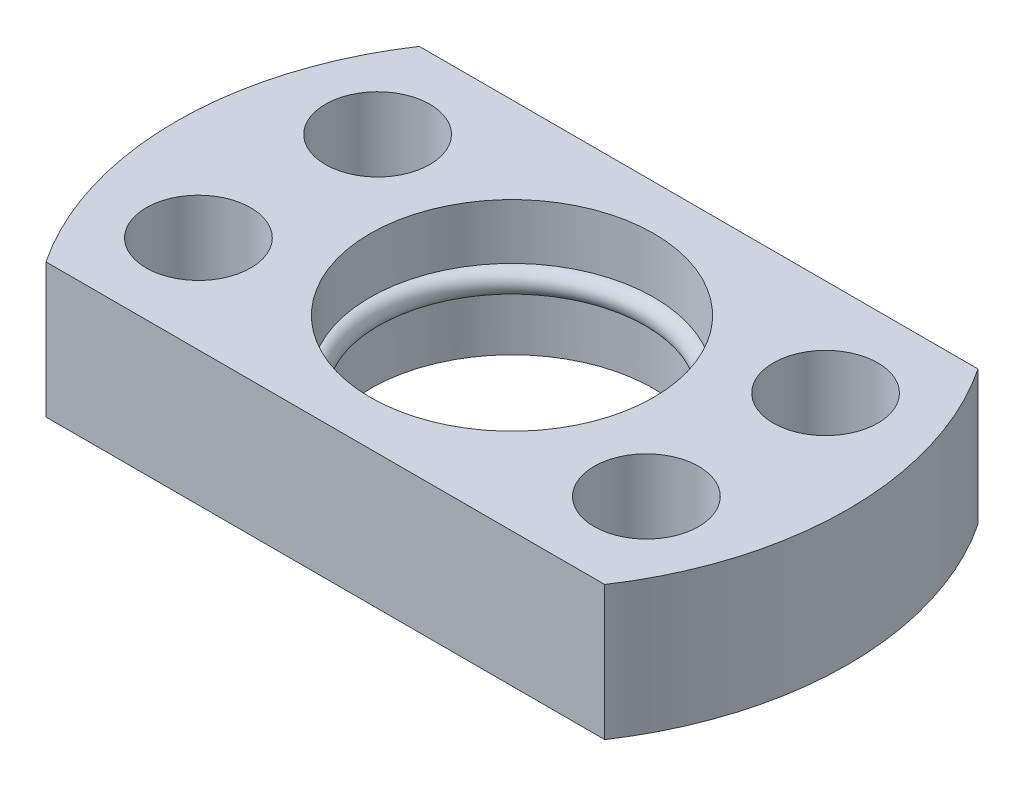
ISO-10303-21;
HEADER;
FILE_DESCRIPTION(('STEP AP214'),'2;1');
FILE_NAME('part.step','',(''),(''),'','','');
FILE_SCHEMA(('AUTOMOTIVE_DESIGN { 1 0 10303 214 1 1 1 1 }'));
ENDSEC;
DATA;
#1=APPLICATION_CONTEXT('core data for automotive mechanical design processes');
#2=APPLICATION_PROTOCOL_DEFINITION('international standard','automotive_design',2000,#1);
#3=PRODUCT_CONTEXT('',#1,'mechanical');
#4=PRODUCT('Part','Part','',(#3));
#5=PRODUCT_RELATED_PRODUCT_CATEGORY('part','',(#4));
#6=PRODUCT_DEFINITION_FORMATION('','',#4);
#7=PRODUCT_DEFINITION_CONTEXT('part definition',#1,'design');
#8=PRODUCT_DEFINITION('design','',#6,#7);
#9=PRODUCT_DEFINITION_SHAPE('','',#8);
#10=(LENGTH_UNIT() NAMED_UNIT(*) SI_UNIT(.MILLI.,.METRE.));
#11=(NAMED_UNIT(*) PLANE_ANGLE_UNIT() SI_UNIT($,.RADIAN.));
#12=(NAMED_UNIT(*) SI_UNIT($,.STERADIAN.) SOLID_ANGLE_UNIT());
#13=UNCERTAINTY_MEASURE_WITH_UNIT(LENGTH_MEASURE(1.E-05),#10,'distance_accuracy_value','');
#14=(GEOMETRIC_REPRESENTATION_CONTEXT(3) GLOBAL_UNCERTAINTY_ASSIGNED_CONTEXT((#13)) GLOBAL_UNIT_ASSIGNED_CONTEXT((#10,
#11,#12)) REPRESENTATION_CONTEXT('',''));
#15=CARTESIAN_POINT('',(0.,0.,0.));
#16=DIRECTION('',(0.,0.,1.));
#17=DIRECTION('',(1.,0.,0.));
#18=AXIS2_PLACEMENT_3D('',#15,#16,#17);
#19=CARTESIAN_POINT('',(0.,4.5,0.));
#20=DIRECTION('',(0.,-1.,0.));
#21=DIRECTION('',(0.,0.,-1.));
#22=AXIS2_PLACEMENT_3D('',#19,#20,#21);
#23=CYLINDRICAL_SURFACE('',#22,9.5);
#24=CARTESIAN_POINT('',(0.,-4.5,0.));
#25=DIRECTION('',(0.,1.,0.));
#26=DIRECTION('',(0.,0.,1.));
#27=AXIS2_PLACEMENT_3D('',#24,#25,#26);
#28=CIRCLE('',#27,9.5);
#29=CARTESIAN_POINT('',(0.,-4.5,9.5));
#30=VERTEX_POINT('',#29);
#31=EDGE_CURVE('E143',#30,#30,#28,.T.);
#32=ORIENTED_EDGE('',*,*,#31,.F.);
#33=EDGE_LOOP('',(#32));
#34=FACE_BOUND('',#33,.T.);
#35=CARTESIAN_POINT('',(0.,-0.800000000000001,0.));
#36=DIRECTION('',(0.,1.,0.));
#37=DIRECTION('',(0.,0.,1.));
#38=AXIS2_PLACEMENT_3D('',#35,#36,#37);
#39=CIRCLE('',#38,9.5);
#40=CARTESIAN_POINT('',(0.,-0.800000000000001,9.5));
#41=VERTEX_POINT('',#40);
#42=EDGE_CURVE('E39',#41,#41,#39,.T.);
#43=ORIENTED_EDGE('',*,*,#42,.T.);
#44=EDGE_LOOP('',(#43));
#45=FACE_BOUND('',#44,.T.);
#46=ADVANCED_FACE('F35',(#34,#45),#23,.F.);
#47=CARTESIAN_POINT('',(0.,4.5,0.));
#48=DIRECTION('',(0.,1.,0.));
#49=DIRECTION('',(0.,0.,1.));
#50=AXIS2_PLACEMENT_3D('',#47,#48,#49);
#51=CIRCLE('',#50,9.5);
#52=CARTESIAN_POINT('',(0.,4.5,9.5));
#53=VERTEX_POINT('',#52);
#54=EDGE_CURVE('E106',#53,#53,#51,.T.);
#55=ORIENTED_EDGE('',*,*,#54,.T.);
#56=EDGE_LOOP('',(#55));
#57=FACE_BOUND('',#56,.T.);
#58=CARTESIAN_POINT('',(0.,0.800000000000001,0.));
#59=DIRECTION('',(0.,-1.,0.));
#60=DIRECTION('',(0.,0.,-1.));
#61=AXIS2_PLACEMENT_3D('',#58,#59,#60);
#62=CIRCLE('',#61,9.5);
#63=CARTESIAN_POINT('',(0.,0.800000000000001,-9.5));
#64=VERTEX_POINT('',#63);
#65=EDGE_CURVE('E111',#64,#64,#62,.T.);
#66=ORIENTED_EDGE('',*,*,#65,.T.);
#67=EDGE_LOOP('',(#66));
#68=FACE_BOUND('',#67,.T.);
#69=ADVANCED_FACE('F155',(#57,#68),#23,.F.);
#70=CARTESIAN_POINT('',(0.,4.5,0.));
#71=DIRECTION('',(0.,1.,0.));
#72=DIRECTION('',(0.,0.,1.));
#73=AXIS2_PLACEMENT_3D('',#70,#71,#72);
#74=PLANE('',#73);
#75=CARTESIAN_POINT('',(-15.,4.5,6.));
#76=DIRECTION('',(0.,1.,0.));
#77=DIRECTION('',(0.,0.,1.));
#78=AXIS2_PLACEMENT_3D('',#75,#76,#77);
#79=CIRCLE('',#78,3.5);
#80=CARTESIAN_POINT('',(-15.,4.5,9.5));
#81=VERTEX_POINT('',#80);
#82=EDGE_CURVE('E128',#81,#81,#79,.T.);
#83=ORIENTED_EDGE('',*,*,#82,.F.);
#84=EDGE_LOOP('',(#83));
#85=FACE_BOUND('',#84,.T.);
#86=CARTESIAN_POINT('',(15.,4.5,6.));
#87=DIRECTION('',(0.,1.,0.));
#88=DIRECTION('',(0.,0.,1.));
#89=AXIS2_PLACEMENT_3D('',#86,#87,#88);
#90=CIRCLE('',#89,3.5);
#91=CARTESIAN_POINT('',(15.,4.5,9.5));
#92=VERTEX_POINT('',#91);
#93=EDGE_CURVE('E140',#92,#92,#90,.T.);
#94=ORIENTED_EDGE('',*,*,#93,.F.);
#95=EDGE_LOOP('',(#94));
#96=FACE_BOUND('',#95,.T.);
#97=CARTESIAN_POINT('',(0.,4.5,0.));
#98=DIRECTION('',(0.,1.,0.));
#99=DIRECTION('',(0.,0.,1.));
#100=AXIS2_PLACEMENT_3D('',#97,#98,#99);
#101=CIRCLE('',#100,22.5);
#102=CARTESIAN_POINT('',(-18.7082869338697,4.5,-12.5));
#103=VERTEX_POINT('',#102);
#104=CARTESIAN_POINT('',(-18.7082869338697,4.5,12.5));
#105=VERTEX_POINT('',#104);
#106=EDGE_CURVE('E90',#103,#105,#101,.T.);
#107=ORIENTED_EDGE('',*,*,#106,.T.);
#108=DIRECTION('',(1.,0.,0.));
#109=VECTOR('',#108,1.);
#110=CARTESIAN_POINT('',(-18.7082869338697,4.5,12.5));
#111=LINE('',#110,#109);
#112=CARTESIAN_POINT('',(18.7082869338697,4.5,12.5));
#113=VERTEX_POINT('',#112);
#114=EDGE_CURVE('E84',#105,#113,#111,.T.);
#115=ORIENTED_EDGE('',*,*,#114,.T.);
#116=CARTESIAN_POINT('',(0.,4.5,0.));
#117=DIRECTION('',(0.,1.,0.));
#118=DIRECTION('',(0.,0.,1.));
#119=AXIS2_PLACEMENT_3D('',#116,#117,#118);
#120=CIRCLE('',#119,22.5);
#121=CARTESIAN_POINT('',(18.7082869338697,4.5,-12.5));
#122=VERTEX_POINT('',#121);
#123=EDGE_CURVE('E88',#113,#122,#120,.T.);
#124=ORIENTED_EDGE('',*,*,#123,.T.);
#125=DIRECTION('',(-1.,0.,0.));
#126=VECTOR('',#125,1.);
#127=CARTESIAN_POINT('',(-18.7082869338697,4.5,-12.5));
#128=LINE('',#127,#126);
#129=EDGE_CURVE('E54',#122,#103,#128,.T.);
#130=ORIENTED_EDGE('',*,*,#129,.T.);
#131=EDGE_LOOP('',(#107,#115,#124,#130));
#132=FACE_BOUND('',#131,.T.);
#133=ORIENTED_EDGE('',*,*,#54,.F.);
#134=EDGE_LOOP('',(#133));
#135=FACE_BOUND('',#134,.T.);
#136=CARTESIAN_POINT('',(-15.,4.5,-6.));
#137=DIRECTION('',(0.,1.,0.));
#138=DIRECTION('',(0.,0.,1.));
#139=AXIS2_PLACEMENT_3D('',#136,#137,#138);
#140=CIRCLE('',#139,3.5);
#141=CARTESIAN_POINT('',(-15.,4.5,-2.5));
#142=VERTEX_POINT('',#141);
#143=EDGE_CURVE('E134',#142,#142,#140,.T.);
#144=ORIENTED_EDGE('',*,*,#143,.F.);
#145=EDGE_LOOP('',(#144));
#146=FACE_BOUND('',#145,.T.);
#147=CARTESIAN_POINT('',(15.,4.5,-6.));
#148=DIRECTION('',(0.,1.,0.));
#149=DIRECTION('',(0.,0.,1.));
#150=AXIS2_PLACEMENT_3D('',#147,#148,#149);
#151=CIRCLE('',#150,3.5);
#152=CARTESIAN_POINT('',(15.,4.5,-2.5));
#153=VERTEX_POINT('',#152);
#154=EDGE_CURVE('E120',#153,#153,#151,.T.);
#155=ORIENTED_EDGE('',*,*,#154,.F.);
#156=EDGE_LOOP('',(#155));
#157=FACE_BOUND('',#156,.T.);
#158=ADVANCED_FACE('F85',(#85,#96,#132,#135,#146,#157),#74,.T.);
#159=CARTESIAN_POINT('',(0.,-4.5,0.));
#160=DIRECTION('',(0.,1.,0.));
#161=DIRECTION('',(0.,0.,1.));
#162=AXIS2_PLACEMENT_3D('',#159,#160,#161);
#163=PLANE('',#162);
#164=CARTESIAN_POINT('',(0.,-4.5,0.));
#165=DIRECTION('',(0.,1.,0.));
#166=DIRECTION('',(0.,0.,1.));
#167=AXIS2_PLACEMENT_3D('',#164,#165,#166);
#168=CIRCLE('',#167,22.5);
#169=CARTESIAN_POINT('',(-18.7082869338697,-4.5,-12.5));
#170=VERTEX_POINT('',#169);
#171=CARTESIAN_POINT('',(-18.7082869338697,-4.5,12.5));
#172=VERTEX_POINT('',#171);
#173=EDGE_CURVE('E103',#170,#172,#168,.T.);
#174=ORIENTED_EDGE('',*,*,#173,.F.);
#175=DIRECTION('',(-1.,0.,0.));
#176=VECTOR('',#175,1.);
#177=CARTESIAN_POINT('',(-18.7082869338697,-4.5,-12.5));
#178=LINE('',#177,#176);
#179=CARTESIAN_POINT('',(18.7082869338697,-4.5,-12.5));
#180=VERTEX_POINT('',#179);
#181=EDGE_CURVE('E77',#180,#170,#178,.T.);
#182=ORIENTED_EDGE('',*,*,#181,.F.);
#183=CARTESIAN_POINT('',(0.,-4.5,0.));
#184=DIRECTION('',(0.,1.,0.));
#185=DIRECTION('',(0.,0.,1.));
#186=AXIS2_PLACEMENT_3D('',#183,#184,#185);
#187=CIRCLE('',#186,22.5);
#188=CARTESIAN_POINT('',(18.7082869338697,-4.5,12.5));
#189=VERTEX_POINT('',#188);
#190=EDGE_CURVE('E71',#189,#180,#187,.T.);
#191=ORIENTED_EDGE('',*,*,#190,.F.);
#192=DIRECTION('',(1.,0.,0.));
#193=VECTOR('',#192,1.);
#194=CARTESIAN_POINT('',(-18.7082869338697,-4.5,12.5));
#195=LINE('',#194,#193);
#196=EDGE_CURVE('E94',#172,#189,#195,.T.);
#197=ORIENTED_EDGE('',*,*,#196,.F.);
#198=EDGE_LOOP('',(#174,#182,#191,#197));
#199=FACE_BOUND('',#198,.T.);
#200=ORIENTED_EDGE('',*,*,#31,.T.);
#201=EDGE_LOOP('',(#200));
#202=FACE_BOUND('',#201,.T.);
#203=CARTESIAN_POINT('',(15.,-4.5,6.));
#204=DIRECTION('',(0.,1.,0.));
#205=DIRECTION('',(0.,0.,1.));
#206=AXIS2_PLACEMENT_3D('',#203,#204,#205);
#207=CIRCLE('',#206,3.5);
#208=CARTESIAN_POINT('',(15.,-4.5,9.5));
#209=VERTEX_POINT('',#208);
#210=EDGE_CURVE('E137',#209,#209,#207,.T.);
#211=ORIENTED_EDGE('',*,*,#210,.T.);
#212=EDGE_LOOP('',(#211));
#213=FACE_BOUND('',#212,.T.);
#214=CARTESIAN_POINT('',(-15.,-4.5,-6.));
#215=DIRECTION('',(0.,1.,0.));
#216=DIRECTION('',(0.,0.,1.));
#217=AXIS2_PLACEMENT_3D('',#214,#215,#216);
#218=CIRCLE('',#217,3.5);
#219=CARTESIAN_POINT('',(-15.,-4.5,-2.5));
#220=VERTEX_POINT('',#219);
#221=EDGE_CURVE('E131',#220,#220,#218,.T.);
#222=ORIENTED_EDGE('',*,*,#221,.T.);
#223=EDGE_LOOP('',(#222));
#224=FACE_BOUND('',#223,.T.);
#225=CARTESIAN_POINT('',(-15.,-4.5,6.));
#226=DIRECTION('',(0.,1.,0.));
#227=DIRECTION('',(0.,0.,1.));
#228=AXIS2_PLACEMENT_3D('',#225,#226,#227);
#229=CIRCLE('',#228,3.5);
#230=CARTESIAN_POINT('',(-15.,-4.5,9.5));
#231=VERTEX_POINT('',#230);
#232=EDGE_CURVE('E125',#231,#231,#229,.T.);
#233=ORIENTED_EDGE('',*,*,#232,.T.);
#234=EDGE_LOOP('',(#233));
#235=FACE_BOUND('',#234,.T.);
#236=CARTESIAN_POINT('',(15.,-4.5,-6.));
#237=DIRECTION('',(0.,1.,0.));
#238=DIRECTION('',(0.,0.,1.));
#239=AXIS2_PLACEMENT_3D('',#236,#237,#238);
#240=CIRCLE('',#239,3.5);
#241=CARTESIAN_POINT('',(15.,-4.5,-2.5));
#242=VERTEX_POINT('',#241);
#243=EDGE_CURVE('E116',#242,#242,#240,.T.);
#244=ORIENTED_EDGE('',*,*,#243,.T.);
#245=EDGE_LOOP('',(#244));
#246=FACE_BOUND('',#245,.T.);
#247=ADVANCED_FACE('F151',(#199,#202,#213,#224,#235,#246),#163,.F.);
#248=CARTESIAN_POINT('',(0.,4.5,0.));
#249=DIRECTION('',(0.,-1.,0.));
#250=DIRECTION('',(0.,0.,-1.));
#251=AXIS2_PLACEMENT_3D('',#248,#249,#250);
#252=CYLINDRICAL_SURFACE('',#251,22.5);
#253=ORIENTED_EDGE('',*,*,#173,.T.);
#254=DIRECTION('',(0.,-1.,0.));
#255=VECTOR('',#254,1.);
#256=CARTESIAN_POINT('',(-18.7082869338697,4.5,12.5));
#257=LINE('',#256,#255);
#258=EDGE_CURVE('E11',#105,#172,#257,.T.);
#259=ORIENTED_EDGE('',*,*,#258,.F.);
#260=ORIENTED_EDGE('',*,*,#106,.F.);
#261=DIRECTION('',(0.,-1.,0.));
#262=VECTOR('',#261,1.);
#263=CARTESIAN_POINT('',(-18.7082869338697,4.5,-12.5));
#264=LINE('',#263,#262);
#265=EDGE_CURVE('E99',#103,#170,#264,.T.);
#266=ORIENTED_EDGE('',*,*,#265,.T.);
#267=EDGE_LOOP('',(#253,#259,#260,#266));
#268=FACE_BOUND('',#267,.T.);
#269=ADVANCED_FACE('F37',(#268),#252,.T.);
#270=CARTESIAN_POINT('',(-18.7082869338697,4.5,12.5));
#271=DIRECTION('',(0.,0.,-1.));
#272=DIRECTION('',(-1.,0.,0.));
#273=AXIS2_PLACEMENT_3D('',#270,#271,#272);
#274=PLANE('',#273);
#275=ORIENTED_EDGE('',*,*,#196,.T.);
#276=DIRECTION('',(0.,-1.,0.));
#277=VECTOR('',#276,1.);
#278=CARTESIAN_POINT('',(18.7082869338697,4.5,12.5));
#279=LINE('',#278,#277);
#280=EDGE_CURVE('E45',#113,#189,#279,.T.);
#281=ORIENTED_EDGE('',*,*,#280,.F.);
#282=ORIENTED_EDGE('',*,*,#114,.F.);
#283=ORIENTED_EDGE('',*,*,#258,.T.);
#284=EDGE_LOOP('',(#275,#281,#282,#283));
#285=FACE_BOUND('',#284,.T.);
#286=ADVANCED_FACE('F93',(#285),#274,.F.);
#287=CARTESIAN_POINT('',(0.,4.5,0.));
#288=DIRECTION('',(0.,-1.,0.));
#289=DIRECTION('',(0.,0.,-1.));
#290=AXIS2_PLACEMENT_3D('',#287,#288,#289);
#291=CYLINDRICAL_SURFACE('',#290,22.5);
#292=ORIENTED_EDGE('',*,*,#190,.T.);
#293=DIRECTION('',(0.,-1.,0.));
#294=VECTOR('',#293,1.);
#295=CARTESIAN_POINT('',(18.7082869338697,4.5,-12.5));
#296=LINE('',#295,#294);
#297=EDGE_CURVE('E95',#122,#180,#296,.T.);
#298=ORIENTED_EDGE('',*,*,#297,.F.);
#299=ORIENTED_EDGE('',*,*,#123,.F.);
#300=ORIENTED_EDGE('',*,*,#280,.T.);
#301=EDGE_LOOP('',(#292,#298,#299,#300));
#302=FACE_BOUND('',#301,.T.);
#303=ADVANCED_FACE('F97',(#302),#291,.T.);
#304=CARTESIAN_POINT('',(-18.7082869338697,4.5,-12.5));
#305=DIRECTION('',(0.,0.,1.));
#306=DIRECTION('',(1.,0.,0.));
#307=AXIS2_PLACEMENT_3D('',#304,#305,#306);
#308=PLANE('',#307);
#309=ORIENTED_EDGE('',*,*,#181,.T.);
#310=ORIENTED_EDGE('',*,*,#265,.F.);
#311=ORIENTED_EDGE('',*,*,#129,.F.);
#312=ORIENTED_EDGE('',*,*,#297,.T.);
#313=EDGE_LOOP('',(#309,#310,#311,#312));
#314=FACE_BOUND('',#313,.T.);
#315=ADVANCED_FACE('F171',(#314),#308,.F.);
#316=CARTESIAN_POINT('',(15.,4.5,6.));
#317=DIRECTION('',(0.,-1.,0.));
#318=DIRECTION('',(0.,0.,-1.));
#319=AXIS2_PLACEMENT_3D('',#316,#317,#318);
#320=CYLINDRICAL_SURFACE('',#319,3.5);
#321=ORIENTED_EDGE('',*,*,#93,.T.);
#322=EDGE_LOOP('',(#321));
#323=FACE_BOUND('',#322,.T.);
#324=ORIENTED_EDGE('',*,*,#210,.F.);
#325=EDGE_LOOP('',(#324));
#326=FACE_BOUND('',#325,.T.);
#327=ADVANCED_FACE('F163',(#323,#326),#320,.F.);
#328=CARTESIAN_POINT('',(-15.,4.5,-6.));
#329=DIRECTION('',(0.,-1.,0.));
#330=DIRECTION('',(0.,0.,-1.));
#331=AXIS2_PLACEMENT_3D('',#328,#329,#330);
#332=CYLINDRICAL_SURFACE('',#331,3.5);
#333=ORIENTED_EDGE('',*,*,#143,.T.);
#334=EDGE_LOOP('',(#333));
#335=FACE_BOUND('',#334,.T.);
#336=ORIENTED_EDGE('',*,*,#221,.F.);
#337=EDGE_LOOP('',(#336));
#338=FACE_BOUND('',#337,.T.);
#339=ADVANCED_FACE('F224',(#335,#338),#332,.F.);
#340=CARTESIAN_POINT('',(-15.,4.5,6.));
#341=DIRECTION('',(0.,-1.,0.));
#342=DIRECTION('',(0.,0.,-1.));
#343=AXIS2_PLACEMENT_3D('',#340,#341,#342);
#344=CYLINDRICAL_SURFACE('',#343,3.5);
#345=ORIENTED_EDGE('',*,*,#82,.T.);
#346=EDGE_LOOP('',(#345));
#347=FACE_BOUND('',#346,.T.);
#348=ORIENTED_EDGE('',*,*,#232,.F.);
#349=EDGE_LOOP('',(#348));
#350=FACE_BOUND('',#349,.T.);
#351=ADVANCED_FACE('F217',(#347,#350),#344,.F.);
#352=CARTESIAN_POINT('',(15.,4.5,-6.));
#353=DIRECTION('',(0.,-1.,0.));
#354=DIRECTION('',(0.,0.,-1.));
#355=AXIS2_PLACEMENT_3D('',#352,#353,#354);
#356=CYLINDRICAL_SURFACE('',#355,3.5);
#357=ORIENTED_EDGE('',*,*,#154,.T.);
#358=EDGE_LOOP('',(#357));
#359=FACE_BOUND('',#358,.T.);
#360=ORIENTED_EDGE('',*,*,#243,.F.);
#361=EDGE_LOOP('',(#360));
#362=FACE_BOUND('',#361,.T.);
#363=ADVANCED_FACE('F208',(#359,#362),#356,.F.);
#364=CARTESIAN_POINT('',(0.,0.,0.));
#365=DIRECTION('',(0.,-1.,0.));
#366=DIRECTION('',(0.,0.,-1.));
#367=AXIS2_PLACEMENT_3D('',#364,#365,#366);
#368=TOROIDAL_SURFACE('',#367,9.5,0.800000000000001);
#369=ORIENTED_EDGE('',*,*,#65,.F.);
#370=EDGE_LOOP('',(#369));
#371=FACE_BOUND('',#370,.T.);
#372=ORIENTED_EDGE('',*,*,#42,.F.);
#373=EDGE_LOOP('',(#372));
#374=FACE_BOUND('',#373,.T.);
#375=ADVANCED_FACE('F204',(#371,#374),#368,.T.);
#376=CLOSED_SHELL('',(#46,#69,#158,#247,#269,#286,#303,#315,#327,#339,#351,#363,#375));
#377=MANIFOLD_SOLID_BREP('B2',#376);
#378=ADVANCED_BREP_SHAPE_REPRESENTATION('',(#18,#377),#14);
#379=SHAPE_DEFINITION_REPRESENTATION(#9,#378);
ENDSEC;
END-ISO-10303-21;
